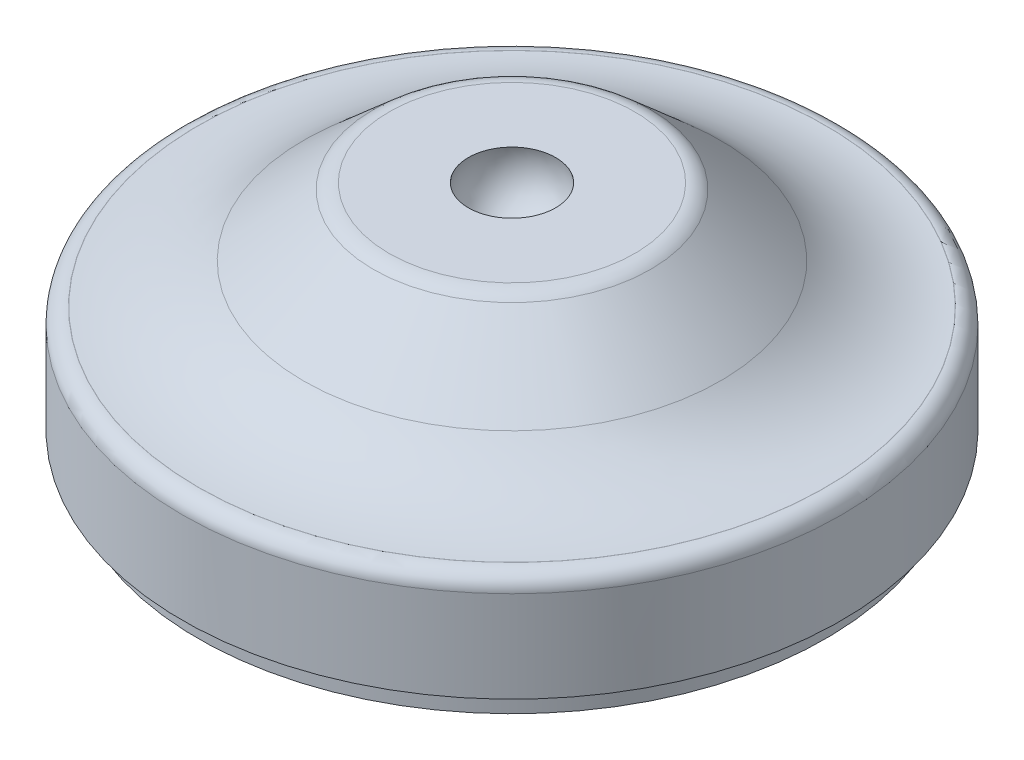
ISO-10303-21;
HEADER;
FILE_DESCRIPTION(('STEP AP214'),'2;1');
FILE_NAME('part.step','',(''),(''),'','','');
FILE_SCHEMA(('AUTOMOTIVE_DESIGN { 1 0 10303 214 1 1 1 1 }'));
ENDSEC;
DATA;
#1=APPLICATION_CONTEXT('core data for automotive mechanical design processes');
#2=APPLICATION_PROTOCOL_DEFINITION('international standard','automotive_design',2000,#1);
#3=PRODUCT_CONTEXT('',#1,'mechanical');
#4=PRODUCT('Part','Part','',(#3));
#5=PRODUCT_RELATED_PRODUCT_CATEGORY('part','',(#4));
#6=PRODUCT_DEFINITION_FORMATION('','',#4);
#7=PRODUCT_DEFINITION_CONTEXT('part definition',#1,'design');
#8=PRODUCT_DEFINITION('design','',#6,#7);
#9=PRODUCT_DEFINITION_SHAPE('','',#8);
#10=(LENGTH_UNIT() NAMED_UNIT(*) SI_UNIT(.MILLI.,.METRE.));
#11=(NAMED_UNIT(*) PLANE_ANGLE_UNIT() SI_UNIT($,.RADIAN.));
#12=(NAMED_UNIT(*) SI_UNIT($,.STERADIAN.) SOLID_ANGLE_UNIT());
#13=UNCERTAINTY_MEASURE_WITH_UNIT(LENGTH_MEASURE(1.E-05),#10,'distance_accuracy_value','');
#14=(GEOMETRIC_REPRESENTATION_CONTEXT(3) GLOBAL_UNCERTAINTY_ASSIGNED_CONTEXT((#13)) GLOBAL_UNIT_ASSIGNED_CONTEXT((#10,
#11,#12)) REPRESENTATION_CONTEXT('',''));
#15=CARTESIAN_POINT('',(0.,0.,0.));
#16=DIRECTION('',(0.,0.,1.));
#17=DIRECTION('',(1.,0.,0.));
#18=AXIS2_PLACEMENT_3D('',#15,#16,#17);
#19=CARTESIAN_POINT('',(0.,28.4210526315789,0.));
#20=DIRECTION('',(-1.,0.,0.));
#21=DIRECTION('',(0.,0.,1.));
#22=AXIS2_PLACEMENT_3D('',#19,#20,#21);
#23=SPHERICAL_SURFACE('',#22,5.71428571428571);
#24=CARTESIAN_POINT('',(5.71428571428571,28.4210526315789,0.));
#25=VERTEX_POINT('',#24);
#26=VERTEX_LOOP('',#25);
#27=FACE_BOUND('',#26,.T.);
#28=CARTESIAN_POINT('',(-5.71428571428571,28.4210526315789,0.));
#29=VERTEX_POINT('',#28);
#30=VERTEX_LOOP('',#29);
#31=FACE_BOUND('',#30,.T.);
#32=CARTESIAN_POINT('',(0.,30.,5.49181085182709));
#33=CARTESIAN_POINT('',(0.154294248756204,30.,5.49181195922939));
#34=CARTESIAN_POINT('',(0.308570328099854,30.,5.48530575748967));
#35=CARTESIAN_POINT('',(0.616077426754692,30.,5.45932636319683));
#36=CARTESIAN_POINT('',(0.769308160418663,30.,5.43984975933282));
#37=CARTESIAN_POINT('',(1.07371861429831,30.,5.38804006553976));
#38=CARTESIAN_POINT('',(1.22489638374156,30.,5.3556955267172));
#39=CARTESIAN_POINT('',(1.52404361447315,30.,5.27836647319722));
#40=CARTESIAN_POINT('',(1.67201188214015,30.,5.23337733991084));
#41=CARTESIAN_POINT('',(1.96350510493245,30.,5.13112756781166));
#42=CARTESIAN_POINT('',(2.10703370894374,30.,5.07387733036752));
#43=CARTESIAN_POINT('',(2.38881026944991,30.,4.94746652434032));
#44=CARTESIAN_POINT('',(2.52705625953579,30.,4.87830157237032));
#45=CARTESIAN_POINT('',(2.79714454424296,30.,4.72861424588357));
#46=CARTESIAN_POINT('',(2.92899074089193,30.,4.6480989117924));
#47=CARTESIAN_POINT('',(3.18548145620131,30.,4.47621889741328));
#48=CARTESIAN_POINT('',(3.31012329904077,30.,4.38485022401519));
#49=CARTESIAN_POINT('',(3.55123437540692,30.,4.19196250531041));
#50=CARTESIAN_POINT('',(3.66770575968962,30.,4.09044614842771));
#51=CARTESIAN_POINT('',(3.89172586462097,30.,3.87792503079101));
#52=CARTESIAN_POINT('',(3.9992712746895,30.,3.76691678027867));
#53=CARTESIAN_POINT('',(4.20459262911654,30.,3.53627175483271));
#54=CARTESIAN_POINT('',(4.30237178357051,30.,3.41663783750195));
#55=CARTESIAN_POINT('',(4.48754028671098,30.,3.16951365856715));
#56=CARTESIAN_POINT('',(4.57492578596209,30.,3.04202051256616));
#57=CARTESIAN_POINT('',(4.73861172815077,30.,2.78017535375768));
#58=CARTESIAN_POINT('',(4.81491645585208,30.,2.64582601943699));
#59=CARTESIAN_POINT('',(4.95596505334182,30.,2.37112726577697));
#60=CARTESIAN_POINT('',(5.02070464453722,30.,2.23077564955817));
#61=CARTESIAN_POINT('',(5.13810593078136,30.,1.94516896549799));
#62=CARTESIAN_POINT('',(5.19077209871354,30.,1.79991573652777));
#63=CARTESIAN_POINT('',(5.28370075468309,30.,1.50543812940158));
#64=CARTESIAN_POINT('',(5.32395865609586,30.,1.35621230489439));
#65=CARTESIAN_POINT('',(5.39174358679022,30.,1.05494326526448));
#66=CARTESIAN_POINT('',(5.41927528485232,30.,0.902901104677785));
#67=CARTESIAN_POINT('',(5.46144941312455,30.,0.597024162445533));
#68=CARTESIAN_POINT('',(5.47608708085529,30.,0.443188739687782));
#69=CARTESIAN_POINT('',(5.50042365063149,30.,-0.0192535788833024));
#70=CARTESIAN_POINT('',(5.4906196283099,30.,-0.329124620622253));
#71=CARTESIAN_POINT('',(5.41912493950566,30.,-0.942653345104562));
#72=CARTESIAN_POINT('',(5.35743425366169,30.,-1.24631102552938));
#73=CARTESIAN_POINT('',(5.18394942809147,30.,-1.83900513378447));
#74=CARTESIAN_POINT('',(5.07215523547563,30.,-2.12804154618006));
#75=CARTESIAN_POINT('',(4.80162833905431,30.,-2.68323101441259));
#76=CARTESIAN_POINT('',(4.64289565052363,30.,-2.94938407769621));
#77=CARTESIAN_POINT('',(4.28300008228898,30.,-3.45126675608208));
#78=CARTESIAN_POINT('',(4.08183721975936,30.,-3.68699638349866));
#79=CARTESIAN_POINT('',(3.64279103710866,30.,-4.12133660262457));
#80=CARTESIAN_POINT('',(3.40490771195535,30.,-4.31994718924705));
#81=CARTESIAN_POINT('',(2.89917356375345,30.,-4.67441243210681));
#82=CARTESIAN_POINT('',(2.6313227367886,30.,-4.83026708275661));
#83=CARTESIAN_POINT('',(2.07325707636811,30.,-5.09479586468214));
#84=CARTESIAN_POINT('',(1.78304224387,30.,-5.20346999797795));
#85=CARTESIAN_POINT('',(1.18848693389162,30.,-5.37055289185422));
#86=CARTESIAN_POINT('',(0.884146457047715,30.,-5.42896165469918));
#87=CARTESIAN_POINT('',(0.269979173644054,30.,-5.49385573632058));
#88=CARTESIAN_POINT('',(-0.0398476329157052,30.,-5.50034105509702));
#89=CARTESIAN_POINT('',(-0.656192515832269,30.,-5.46120417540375));
#90=CARTESIAN_POINT('',(-0.96271059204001,30.,-5.41558197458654));
#91=CARTESIAN_POINT('',(-1.56373687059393,30.,-5.27352504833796));
#92=CARTESIAN_POINT('',(-1.85824507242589,30.,-5.17709032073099));
#93=CARTESIAN_POINT('',(-2.42689131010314,30.,-4.93614614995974));
#94=CARTESIAN_POINT('',(-2.70102934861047,30.,-4.79163671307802));
#95=CARTESIAN_POINT('',(-3.22115336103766,30.,-4.45864423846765));
#96=CARTESIAN_POINT('',(-3.46713933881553,30.,-4.27016120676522));
#97=CARTESIAN_POINT('',(-3.92397630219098,30.,-3.85457603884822));
#98=CARTESIAN_POINT('',(-4.13482727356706,30.,-3.62747388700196));
#99=CARTESIAN_POINT('',(-4.51540964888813,30.,-3.14108186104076));
#100=CARTESIAN_POINT('',(-4.68514103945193,30.,-2.88179197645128));
#101=CARTESIAN_POINT('',(-4.97866237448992,30.,-2.33844262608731));
#102=CARTESIAN_POINT('',(-5.10245236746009,30.,-2.05438318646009));
#103=CARTESIAN_POINT('',(-5.30058998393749,30.,-1.46934432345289));
#104=CARTESIAN_POINT('',(-5.37493762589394,30.,-1.16836490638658));
#105=CARTESIAN_POINT('',(-5.4477845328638,30.,-0.711048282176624));
#106=CARTESIAN_POINT('',(-5.46562024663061,30.,-0.557550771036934));
#107=CARTESIAN_POINT('',(-5.48830280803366,30.,-0.249614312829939));
#108=CARTESIAN_POINT('',(-5.49315444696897,30.,-0.0951757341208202));
#109=CARTESIAN_POINT('',(-5.48982874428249,30.,0.213606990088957));
#110=CARTESIAN_POINT('',(-5.48164661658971,30.,0.367951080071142));
#111=CARTESIAN_POINT('',(-5.45231307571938,30.,0.675347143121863));
#112=CARTESIAN_POINT('',(-5.43116645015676,30.,0.828399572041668));
#113=CARTESIAN_POINT('',(-5.37604675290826,30.,1.13223515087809));
#114=CARTESIAN_POINT('',(-5.34206892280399,30.,1.28301743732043));
#115=CARTESIAN_POINT('',(-5.26154444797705,30.,1.58112802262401));
#116=CARTESIAN_POINT('',(-5.2150024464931,30.,1.72845757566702));
#117=CARTESIAN_POINT('',(-5.10965423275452,30.,2.01872939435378));
#118=CARTESIAN_POINT('',(-5.05084327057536,30.,2.16166993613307));
#119=CARTESIAN_POINT('',(-4.92141033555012,30.,2.44203550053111));
#120=CARTESIAN_POINT('',(-4.85079272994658,30.,2.57946253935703));
#121=CARTESIAN_POINT('',(-4.69820797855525,30.,2.84792460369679));
#122=CARTESIAN_POINT('',(-4.61623709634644,30.,2.97895750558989));
#123=CARTESIAN_POINT('',(-4.44157878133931,30.,3.23360374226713));
#124=CARTESIAN_POINT('',(-4.34889531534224,30.,3.35721979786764));
#125=CARTESIAN_POINT('',(-4.15342024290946,30.,3.59623803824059));
#126=CARTESIAN_POINT('',(-4.0506259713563,30.,3.71163804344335));
#127=CARTESIAN_POINT('',(-3.83572046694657,30.,3.93332667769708));
#128=CARTESIAN_POINT('',(-3.7236126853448,30.,4.03961865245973));
#129=CARTESIAN_POINT('',(-3.49077181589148,30.,4.24244642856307));
#130=CARTESIAN_POINT('',(-3.3700334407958,30.,4.33897616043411));
#131=CARTESIAN_POINT('',(-3.12089782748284,30.,4.52148415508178));
#132=CARTESIAN_POINT('',(-2.99250342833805,30.,4.60746629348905));
#133=CARTESIAN_POINT('',(-2.72881629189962,30.,4.76837747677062));
#134=CARTESIAN_POINT('',(-2.59351781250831,30.,4.84329711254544));
#135=CARTESIAN_POINT('',(-2.31713749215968,30.,4.98143750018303));
#136=CARTESIAN_POINT('',(-2.17605778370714,30.,5.04466251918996));
#137=CARTESIAN_POINT('',(-1.88919715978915,30.,5.15894703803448));
#138=CARTESIAN_POINT('',(-1.74342054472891,30.,5.21001732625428));
#139=CARTESIAN_POINT('',(-1.44813336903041,30.,5.29968910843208));
#140=CARTESIAN_POINT('',(-1.2986238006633,30.,5.33829387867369));
#141=CARTESIAN_POINT('',(-0.95930017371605,30.,5.41080809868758));
#142=CARTESIAN_POINT('',(-0.768715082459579,30.,5.44115835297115));
#143=CARTESIAN_POINT('',(-0.385410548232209,30.,5.4816590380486));
#144=CARTESIAN_POINT('',(-0.19269110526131,30.,5.49180946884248));
#145=CARTESIAN_POINT('',(0.,30.,5.49181085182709));
#146=B_SPLINE_CURVE_WITH_KNOTS('',3,(#32,#33,#34,#35,#36,#37,#38,#39,#40,#41,#42,#43,#44,#45,
#46,#47,#48,#49,#50,#51,#52,#53,#54,#55,#56,#57,#58,#59,#60,#61,#62,#63,#64,#65,#66,#67,#68,#69,
#70,#71,#72,#73,#74,#75,#76,#77,#78,#79,#80,#81,#82,#83,#84,#85,#86,#87,#88,#89,#90,#91,#92,#93,
#94,#95,#96,#97,#98,#99,#100,#101,#102,#103,#104,#105,#106,#107,#108,#109,#110,#111,#112,#113,
#114,#115,#116,#117,#118,#119,#120,#121,#122,#123,#124,#125,#126,#127,#128,#129,#130,#131,#132,
#133,#134,#135,#136,#137,#138,#139,#140,#141,#142,#143,#144,#145),.UNSPECIFIED.,.T.,.F.,(4,2,2,
2,2,2,2,2,2,2,2,2,2,2,2,2,2,2,2,2,2,2,2,2,2,2,2,2,2,2,2,2,2,2,2,2,2,2,2,2,2,2,2,2,2,2,2,2,2,2,2,
2,2,2,2,2,4),(0.,0.462714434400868,0.925550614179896,1.38879951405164,1.85221784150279,
2.31524458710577,2.77844204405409,3.24135344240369,3.70443568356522,4.16739556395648,
4.63052639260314,5.09350448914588,5.55665352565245,6.0196229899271,6.48276337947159,
6.94573190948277,7.40887136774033,7.87184078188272,8.33498112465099,9.26026583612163,
10.1855508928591,11.1108369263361,12.0361226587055,12.9614080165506,13.8866935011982,
14.811979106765,15.7372646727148,16.6625501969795,17.5878357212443,18.513121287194,
19.4384068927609,20.3636923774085,21.2889777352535,22.214263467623,23.1395495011,
24.0648345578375,24.9901192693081,25.4532596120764,25.9162290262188,26.3793684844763,
26.8423370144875,27.305477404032,27.7684468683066,28.2315959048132,28.694574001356,
29.1577048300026,29.6206647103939,30.0837469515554,30.546658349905,31.0098558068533,
31.4728825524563,31.9363008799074,32.3995497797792,32.8623859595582,33.3251003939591,
33.9029635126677,34.4808266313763),.UNSPECIFIED.);
#147=CARTESIAN_POINT('',(0.,30.,5.49181085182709));
#148=VERTEX_POINT('',#147);
#149=EDGE_CURVE('E21',#148,#148,#146,.T.);
#150=ORIENTED_EDGE('',*,*,#149,.T.);
#151=EDGE_LOOP('',(#150));
#152=FACE_BOUND('',#151,.T.);
#153=ADVANCED_FACE('F16',(#27,#31,#152),#23,.F.);
#154=CARTESIAN_POINT('',(-15.4669679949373,30.,0.));
#155=DIRECTION('',(0.,-1.,0.));
#156=DIRECTION('',(0.,0.,-1.));
#157=AXIS2_PLACEMENT_3D('',#154,#155,#156);
#158=PLANE('',#157);
#159=CARTESIAN_POINT('',(0.,30.,0.));
#160=DIRECTION('',(0.,-1.,0.));
#161=DIRECTION('',(0.,0.,1.));
#162=AXIS2_PLACEMENT_3D('',#159,#160,#161);
#163=CIRCLE('',#162,15.4669679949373);
#164=CARTESIAN_POINT('',(0.,30.,15.4669679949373));
#165=VERTEX_POINT('',#164);
#166=EDGE_CURVE('E41',#165,#165,#163,.T.);
#167=ORIENTED_EDGE('',*,*,#166,.F.);
#168=EDGE_LOOP('',(#167));
#169=FACE_BOUND('',#168,.T.);
#170=ORIENTED_EDGE('',*,*,#149,.F.);
#171=EDGE_LOOP('',(#170));
#172=FACE_BOUND('',#171,.T.);
#173=ADVANCED_FACE('F37',(#169,#172),#158,.F.);
#174=CARTESIAN_POINT('',(0.,27.,0.));
#175=DIRECTION('',(0.,1.,0.));
#176=DIRECTION('',(0.,0.,1.));
#177=AXIS2_PLACEMENT_3D('',#174,#175,#176);
#178=TOROIDAL_SURFACE('',#177,15.4669679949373,3.00000000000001);
#179=ORIENTED_EDGE('',*,*,#166,.T.);
#180=EDGE_LOOP('',(#179));
#181=FACE_BOUND('',#180,.T.);
#182=CARTESIAN_POINT('',(0.,29.250996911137,0.));
#183=DIRECTION('',(0.,-1.,0.));
#184=DIRECTION('',(0.,0.,-1.));
#185=AXIS2_PLACEMENT_3D('',#182,#183,#184);
#186=CIRCLE('',#185,17.4501505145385);
#187=CARTESIAN_POINT('',(0.,29.250996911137,-17.4501505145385));
#188=VERTEX_POINT('',#187);
#189=EDGE_CURVE('E43',#188,#188,#186,.T.);
#190=ORIENTED_EDGE('',*,*,#189,.F.);
#191=EDGE_LOOP('',(#190));
#192=FACE_BOUND('',#191,.T.);
#193=ADVANCED_FACE('F67',(#181,#192),#178,.T.);
#194=CARTESIAN_POINT('',(0.,21.4933539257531,0.));
#195=DIRECTION('',(0.,-1.,0.));
#196=DIRECTION('',(1.,0.,0.));
#197=AXIS2_PLACEMENT_3D('',#194,#195,#196);
#198=CONICAL_SURFACE('',#197,26.2554068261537,0.848564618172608);
#199=CARTESIAN_POINT('',(0.,21.4933539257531,0.));
#200=DIRECTION('',(0.,1.,0.));
#201=DIRECTION('',(0.,0.,1.));
#202=AXIS2_PLACEMENT_3D('',#199,#200,#201);
#203=CIRCLE('',#202,26.2554068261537);
#204=CARTESIAN_POINT('',(0.,21.4933539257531,26.2554068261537));
#205=VERTEX_POINT('',#204);
#206=EDGE_CURVE('E48',#205,#205,#203,.T.);
#207=ORIENTED_EDGE('',*,*,#206,.T.);
#208=EDGE_LOOP('',(#207));
#209=FACE_BOUND('',#208,.T.);
#210=ORIENTED_EDGE('',*,*,#189,.T.);
#211=EDGE_LOOP('',(#210));
#212=FACE_BOUND('',#211,.T.);
#213=ADVANCED_FACE('F71',(#209,#212),#198,.T.);
#214=CARTESIAN_POINT('',(0.,36.5,0.));
#215=DIRECTION('',(0.,1.,0.));
#216=DIRECTION('',(0.,0.,1.));
#217=AXIS2_PLACEMENT_3D('',#214,#215,#216);
#218=TOROIDAL_SURFACE('',#217,39.4766236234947,20.);
#219=CARTESIAN_POINT('',(0.,16.5,0.));
#220=DIRECTION('',(0.,1.,0.));
#221=DIRECTION('',(0.,0.,1.));
#222=AXIS2_PLACEMENT_3D('',#219,#220,#221);
#223=CIRCLE('',#222,39.4766236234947);
#224=CARTESIAN_POINT('',(0.,16.5,39.4766236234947));
#225=VERTEX_POINT('',#224);
#226=EDGE_CURVE('E53',#225,#225,#223,.T.);
#227=ORIENTED_EDGE('',*,*,#226,.T.);
#228=EDGE_LOOP('',(#227));
#229=FACE_BOUND('',#228,.T.);
#230=ORIENTED_EDGE('',*,*,#206,.F.);
#231=EDGE_LOOP('',(#230));
#232=FACE_BOUND('',#231,.T.);
#233=ADVANCED_FACE('F126',(#229,#232),#218,.F.);
#234=CARTESIAN_POINT('',(-39.5,16.5,0.));
#235=DIRECTION('',(0.,-1.,0.));
#236=DIRECTION('',(0.,0.,-1.));
#237=AXIS2_PLACEMENT_3D('',#234,#235,#236);
#238=PLANE('',#237);
#239=CARTESIAN_POINT('',(0.,16.5,0.));
#240=DIRECTION('',(0.,-1.,0.));
#241=DIRECTION('',(0.,0.,1.));
#242=AXIS2_PLACEMENT_3D('',#239,#240,#241);
#243=CIRCLE('',#242,39.5);
#244=CARTESIAN_POINT('',(0.,16.5,39.5));
#245=VERTEX_POINT('',#244);
#246=EDGE_CURVE('E90',#245,#245,#243,.T.);
#247=ORIENTED_EDGE('',*,*,#246,.F.);
#248=EDGE_LOOP('',(#247));
#249=FACE_BOUND('',#248,.T.);
#250=ORIENTED_EDGE('',*,*,#226,.F.);
#251=EDGE_LOOP('',(#250));
#252=FACE_BOUND('',#251,.T.);
#253=ADVANCED_FACE('F109',(#249,#252),#238,.F.);
#254=CARTESIAN_POINT('',(0.,14.5,0.));
#255=DIRECTION('',(0.,1.,0.));
#256=DIRECTION('',(0.,0.,1.));
#257=AXIS2_PLACEMENT_3D('',#254,#255,#256);
#258=TOROIDAL_SURFACE('',#257,39.5,2.00000000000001);
#259=ORIENTED_EDGE('',*,*,#246,.T.);
#260=EDGE_LOOP('',(#259));
#261=FACE_BOUND('',#260,.T.);
#262=CARTESIAN_POINT('',(0.,14.5,0.));
#263=DIRECTION('',(0.,-1.,0.));
#264=DIRECTION('',(0.,0.,-1.));
#265=AXIS2_PLACEMENT_3D('',#262,#263,#264);
#266=CIRCLE('',#265,41.5);
#267=CARTESIAN_POINT('',(0.,14.5,-41.5));
#268=VERTEX_POINT('',#267);
#269=EDGE_CURVE('E86',#268,#268,#266,.T.);
#270=ORIENTED_EDGE('',*,*,#269,.F.);
#271=EDGE_LOOP('',(#270));
#272=FACE_BOUND('',#271,.T.);
#273=ADVANCED_FACE('F103',(#261,#272),#258,.T.);
#274=CARTESIAN_POINT('',(0.,22.7067669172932,0.));
#275=DIRECTION('',(0.,-1.,0.));
#276=DIRECTION('',(0.,0.,-1.));
#277=AXIS2_PLACEMENT_3D('',#274,#275,#276);
#278=CYLINDRICAL_SURFACE('',#277,41.5);
#279=CARTESIAN_POINT('',(0.,3.,0.));
#280=DIRECTION('',(0.,-1.,0.));
#281=DIRECTION('',(0.,0.,-1.));
#282=AXIS2_PLACEMENT_3D('',#279,#280,#281);
#283=CIRCLE('',#282,41.5);
#284=CARTESIAN_POINT('',(0.,3.,-41.5));
#285=VERTEX_POINT('',#284);
#286=EDGE_CURVE('E84',#285,#285,#283,.F.);
#287=ORIENTED_EDGE('',*,*,#286,.T.);
#288=EDGE_LOOP('',(#287));
#289=FACE_BOUND('',#288,.T.);
#290=ORIENTED_EDGE('',*,*,#269,.T.);
#291=EDGE_LOOP('',(#290));
#292=FACE_BOUND('',#291,.T.);
#293=ADVANCED_FACE('F108',(#289,#292),#278,.T.);
#294=CARTESIAN_POINT('',(-39.5,3.,0.));
#295=DIRECTION('',(0.,1.,0.));
#296=DIRECTION('',(0.,0.,1.));
#297=AXIS2_PLACEMENT_3D('',#294,#295,#296);
#298=PLANE('',#297);
#299=CARTESIAN_POINT('',(0.,3.,0.));
#300=DIRECTION('',(0.,-1.,0.));
#301=DIRECTION('',(0.,0.,-1.));
#302=AXIS2_PLACEMENT_3D('',#299,#300,#301);
#303=CIRCLE('',#302,39.5);
#304=CARTESIAN_POINT('',(0.,3.,-39.5));
#305=VERTEX_POINT('',#304);
#306=EDGE_CURVE('E28',#305,#305,#303,.T.);
#307=ORIENTED_EDGE('',*,*,#306,.F.);
#308=EDGE_LOOP('',(#307));
#309=FACE_BOUND('',#308,.T.);
#310=ORIENTED_EDGE('',*,*,#286,.F.);
#311=EDGE_LOOP('',(#310));
#312=FACE_BOUND('',#311,.T.);
#313=ADVANCED_FACE('F147',(#309,#312),#298,.F.);
#314=CARTESIAN_POINT('',(0.,22.7067669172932,0.));
#315=DIRECTION('',(0.,-1.,0.));
#316=DIRECTION('',(0.,0.,-1.));
#317=AXIS2_PLACEMENT_3D('',#314,#315,#316);
#318=CYLINDRICAL_SURFACE('',#317,39.5);
#319=CARTESIAN_POINT('',(0.,0.,0.));
#320=DIRECTION('',(0.,-1.,0.));
#321=DIRECTION('',(0.,0.,-1.));
#322=AXIS2_PLACEMENT_3D('',#319,#320,#321);
#323=CIRCLE('',#322,39.5);
#324=CARTESIAN_POINT('',(0.,0.,-39.5));
#325=VERTEX_POINT('',#324);
#326=EDGE_CURVE('E11',#325,#325,#323,.F.);
#327=ORIENTED_EDGE('',*,*,#326,.T.);
#328=EDGE_LOOP('',(#327));
#329=FACE_BOUND('',#328,.T.);
#330=ORIENTED_EDGE('',*,*,#306,.T.);
#331=EDGE_LOOP('',(#330));
#332=FACE_BOUND('',#331,.T.);
#333=ADVANCED_FACE('F141',(#329,#332),#318,.T.);
#334=CARTESIAN_POINT('',(0.,0.,0.));
#335=DIRECTION('',(0.,1.,0.));
#336=DIRECTION('',(0.,0.,1.));
#337=AXIS2_PLACEMENT_3D('',#334,#335,#336);
#338=PLANE('',#337);
#339=ORIENTED_EDGE('',*,*,#326,.F.);
#340=EDGE_LOOP('',(#339));
#341=FACE_BOUND('',#340,.T.);
#342=ADVANCED_FACE('F139',(#341),#338,.F.);
#343=CLOSED_SHELL('',(#153,#173,#193,#213,#233,#253,#273,#293,#313,#333,#342));
#344=MANIFOLD_SOLID_BREP('B1',#343);
#345=ADVANCED_BREP_SHAPE_REPRESENTATION('',(#18,#344),#14);
#346=SHAPE_DEFINITION_REPRESENTATION(#9,#345);
ENDSEC;
END-ISO-10303-21;
